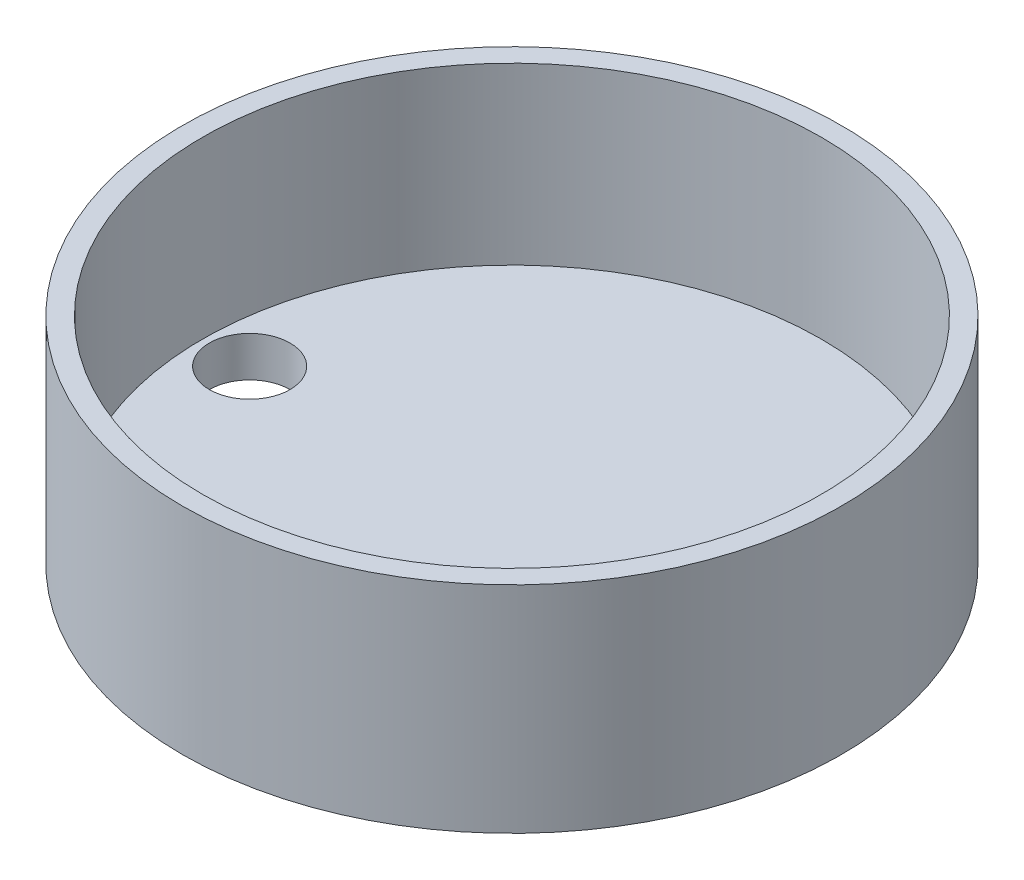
ISO-10303-21;
HEADER;
FILE_DESCRIPTION(('STEP AP214'),'2;1');
FILE_NAME('part.step','',(''),(''),'','','');
FILE_SCHEMA(('AUTOMOTIVE_DESIGN { 1 0 10303 214 1 1 1 1 }'));
ENDSEC;
DATA;
#1=APPLICATION_CONTEXT('core data for automotive mechanical design processes');
#2=APPLICATION_PROTOCOL_DEFINITION('international standard','automotive_design',2000,#1);
#3=PRODUCT_CONTEXT('',#1,'mechanical');
#4=PRODUCT('Part','Part','',(#3));
#5=PRODUCT_RELATED_PRODUCT_CATEGORY('part','',(#4));
#6=PRODUCT_DEFINITION_FORMATION('','',#4);
#7=PRODUCT_DEFINITION_CONTEXT('part definition',#1,'design');
#8=PRODUCT_DEFINITION('design','',#6,#7);
#9=PRODUCT_DEFINITION_SHAPE('','',#8);
#10=(LENGTH_UNIT() NAMED_UNIT(*) SI_UNIT(.MILLI.,.METRE.));
#11=(NAMED_UNIT(*) PLANE_ANGLE_UNIT() SI_UNIT($,.RADIAN.));
#12=(NAMED_UNIT(*) SI_UNIT($,.STERADIAN.) SOLID_ANGLE_UNIT());
#13=UNCERTAINTY_MEASURE_WITH_UNIT(LENGTH_MEASURE(1.E-05),#10,'distance_accuracy_value','');
#14=(GEOMETRIC_REPRESENTATION_CONTEXT(3) GLOBAL_UNCERTAINTY_ASSIGNED_CONTEXT((#13)) GLOBAL_UNIT_ASSIGNED_CONTEXT((#10,
#11,#12)) REPRESENTATION_CONTEXT('',''));
#15=CARTESIAN_POINT('',(0.,0.,0.));
#16=DIRECTION('',(0.,0.,1.));
#17=DIRECTION('',(1.,0.,0.));
#18=AXIS2_PLACEMENT_3D('',#15,#16,#17);
#19=CARTESIAN_POINT('',(0.,-50.8,0.));
#20=DIRECTION('',(0.,1.,0.));
#21=DIRECTION('',(0.,0.,1.));
#22=AXIS2_PLACEMENT_3D('',#19,#20,#21);
#23=CYLINDRICAL_SURFACE('',#22,77.7875);
#24=CARTESIAN_POINT('',(0.,-50.8,0.));
#25=DIRECTION('',(0.,1.,0.));
#26=DIRECTION('',(0.,0.,1.));
#27=AXIS2_PLACEMENT_3D('',#24,#25,#26);
#28=CIRCLE('',#27,77.7875);
#29=CARTESIAN_POINT('',(0.,-50.8,77.7875));
#30=VERTEX_POINT('',#29);
#31=EDGE_CURVE('E10',#30,#30,#28,.T.);
#32=ORIENTED_EDGE('',*,*,#31,.T.);
#33=EDGE_LOOP('',(#32));
#34=FACE_BOUND('',#33,.T.);
#35=CARTESIAN_POINT('',(0.,0.,0.));
#36=DIRECTION('',(0.,1.,0.));
#37=DIRECTION('',(0.,0.,1.));
#38=AXIS2_PLACEMENT_3D('',#35,#36,#37);
#39=CIRCLE('',#38,77.7875);
#40=CARTESIAN_POINT('',(0.,0.,77.7875));
#41=VERTEX_POINT('',#40);
#42=EDGE_CURVE('E38',#41,#41,#39,.T.);
#43=ORIENTED_EDGE('',*,*,#42,.F.);
#44=EDGE_LOOP('',(#43));
#45=FACE_BOUND('',#44,.T.);
#46=ADVANCED_FACE('F31',(#34,#45),#23,.T.);
#47=CARTESIAN_POINT('',(0.,-50.8,0.));
#48=DIRECTION('',(0.,1.,0.));
#49=DIRECTION('',(0.,0.,1.));
#50=AXIS2_PLACEMENT_3D('',#47,#48,#49);
#51=PLANE('',#50);
#52=CARTESIAN_POINT('',(61.8998,-50.8,0.));
#53=DIRECTION('',(0.,-1.,0.));
#54=DIRECTION('',(0.,0.,-1.));
#55=AXIS2_PLACEMENT_3D('',#52,#53,#54);
#56=CIRCLE('',#55,9.52500000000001);
#57=CARTESIAN_POINT('',(61.8998,-50.8,-9.52500000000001));
#58=VERTEX_POINT('',#57);
#59=EDGE_CURVE('E50',#58,#58,#56,.T.);
#60=ORIENTED_EDGE('',*,*,#59,.F.);
#61=EDGE_LOOP('',(#60));
#62=FACE_BOUND('',#61,.T.);
#63=CARTESIAN_POINT('',(-61.8998,-50.8,0.));
#64=DIRECTION('',(0.,-1.,0.));
#65=DIRECTION('',(0.,0.,-1.));
#66=AXIS2_PLACEMENT_3D('',#63,#64,#65);
#67=CIRCLE('',#66,9.525);
#68=CARTESIAN_POINT('',(-61.8998,-50.8,-9.525));
#69=VERTEX_POINT('',#68);
#70=EDGE_CURVE('E55',#69,#69,#67,.T.);
#71=ORIENTED_EDGE('',*,*,#70,.F.);
#72=EDGE_LOOP('',(#71));
#73=FACE_BOUND('',#72,.T.);
#74=ORIENTED_EDGE('',*,*,#31,.F.);
#75=EDGE_LOOP('',(#74));
#76=FACE_BOUND('',#75,.T.);
#77=ADVANCED_FACE('F72',(#62,#73,#76),#51,.F.);
#78=CARTESIAN_POINT('',(0.,0.,0.));
#79=DIRECTION('',(0.,1.,0.));
#80=DIRECTION('',(0.,0.,1.));
#81=AXIS2_PLACEMENT_3D('',#78,#79,#80);
#82=PLANE('',#81);
#83=CARTESIAN_POINT('',(0.,0.,0.));
#84=DIRECTION('',(0.,1.,0.));
#85=DIRECTION('',(0.,0.,1.));
#86=AXIS2_PLACEMENT_3D('',#83,#84,#85);
#87=CIRCLE('',#86,73.025);
#88=CARTESIAN_POINT('',(0.,0.,73.025));
#89=VERTEX_POINT('',#88);
#90=EDGE_CURVE('E46',#89,#89,#87,.T.);
#91=ORIENTED_EDGE('',*,*,#90,.F.);
#92=EDGE_LOOP('',(#91));
#93=FACE_BOUND('',#92,.T.);
#94=ORIENTED_EDGE('',*,*,#42,.T.);
#95=EDGE_LOOP('',(#94));
#96=FACE_BOUND('',#95,.T.);
#97=ADVANCED_FACE('F69',(#93,#96),#82,.T.);
#98=CARTESIAN_POINT('',(0.,-41.275,0.));
#99=DIRECTION('',(0.,1.,0.));
#100=DIRECTION('',(0.,0.,1.));
#101=AXIS2_PLACEMENT_3D('',#98,#99,#100);
#102=CYLINDRICAL_SURFACE('',#101,73.025);
#103=CARTESIAN_POINT('',(0.,-41.275,0.));
#104=DIRECTION('',(0.,1.,0.));
#105=DIRECTION('',(0.,0.,1.));
#106=AXIS2_PLACEMENT_3D('',#103,#104,#105);
#107=CIRCLE('',#106,73.025);
#108=CARTESIAN_POINT('',(0.,-41.275,73.025));
#109=VERTEX_POINT('',#108);
#110=EDGE_CURVE('E43',#109,#109,#107,.T.);
#111=ORIENTED_EDGE('',*,*,#110,.F.);
#112=EDGE_LOOP('',(#111));
#113=FACE_BOUND('',#112,.T.);
#114=ORIENTED_EDGE('',*,*,#90,.T.);
#115=EDGE_LOOP('',(#114));
#116=FACE_BOUND('',#115,.T.);
#117=ADVANCED_FACE('F67',(#113,#116),#102,.F.);
#118=CARTESIAN_POINT('',(0.,-41.275,0.));
#119=DIRECTION('',(0.,1.,0.));
#120=DIRECTION('',(0.,0.,1.));
#121=AXIS2_PLACEMENT_3D('',#118,#119,#120);
#122=PLANE('',#121);
#123=CARTESIAN_POINT('',(61.8998,-41.275,0.));
#124=DIRECTION('',(0.,1.,0.));
#125=DIRECTION('',(0.,0.,1.));
#126=AXIS2_PLACEMENT_3D('',#123,#124,#125);
#127=CIRCLE('',#126,9.52500000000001);
#128=CARTESIAN_POINT('',(61.8998,-41.275,9.52500000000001));
#129=VERTEX_POINT('',#128);
#130=EDGE_CURVE('E34',#129,#129,#127,.T.);
#131=ORIENTED_EDGE('',*,*,#130,.F.);
#132=EDGE_LOOP('',(#131));
#133=FACE_BOUND('',#132,.T.);
#134=CARTESIAN_POINT('',(-61.8998,-41.275,0.));
#135=DIRECTION('',(0.,1.,0.));
#136=DIRECTION('',(0.,0.,1.));
#137=AXIS2_PLACEMENT_3D('',#134,#135,#136);
#138=CIRCLE('',#137,9.525);
#139=CARTESIAN_POINT('',(-61.8998,-41.275,9.525));
#140=VERTEX_POINT('',#139);
#141=EDGE_CURVE('E48',#140,#140,#138,.T.);
#142=ORIENTED_EDGE('',*,*,#141,.F.);
#143=EDGE_LOOP('',(#142));
#144=FACE_BOUND('',#143,.T.);
#145=ORIENTED_EDGE('',*,*,#110,.T.);
#146=EDGE_LOOP('',(#145));
#147=FACE_BOUND('',#146,.T.);
#148=ADVANCED_FACE('F89',(#133,#144,#147),#122,.T.);
#149=CARTESIAN_POINT('',(-61.8998,0.,0.));
#150=DIRECTION('',(0.,-1.,0.));
#151=DIRECTION('',(0.,0.,-1.));
#152=AXIS2_PLACEMENT_3D('',#149,#150,#151);
#153=CYLINDRICAL_SURFACE('',#152,9.525);
#154=ORIENTED_EDGE('',*,*,#141,.T.);
#155=EDGE_LOOP('',(#154));
#156=FACE_BOUND('',#155,.T.);
#157=ORIENTED_EDGE('',*,*,#70,.T.);
#158=EDGE_LOOP('',(#157));
#159=FACE_BOUND('',#158,.T.);
#160=ADVANCED_FACE('F92',(#156,#159),#153,.F.);
#161=CARTESIAN_POINT('',(61.8998,0.,0.));
#162=DIRECTION('',(0.,-1.,0.));
#163=DIRECTION('',(0.,0.,-1.));
#164=AXIS2_PLACEMENT_3D('',#161,#162,#163);
#165=CYLINDRICAL_SURFACE('',#164,9.52500000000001);
#166=ORIENTED_EDGE('',*,*,#130,.T.);
#167=EDGE_LOOP('',(#166));
#168=FACE_BOUND('',#167,.T.);
#169=ORIENTED_EDGE('',*,*,#59,.T.);
#170=EDGE_LOOP('',(#169));
#171=FACE_BOUND('',#170,.T.);
#172=ADVANCED_FACE('F96',(#168,#171),#165,.F.);
#173=CLOSED_SHELL('',(#46,#77,#97,#117,#148,#160,#172));
#174=MANIFOLD_SOLID_BREP('B2',#173);
#175=ADVANCED_BREP_SHAPE_REPRESENTATION('',(#18,#174),#14);
#176=SHAPE_DEFINITION_REPRESENTATION(#9,#175);
ENDSEC;
END-ISO-10303-21;
